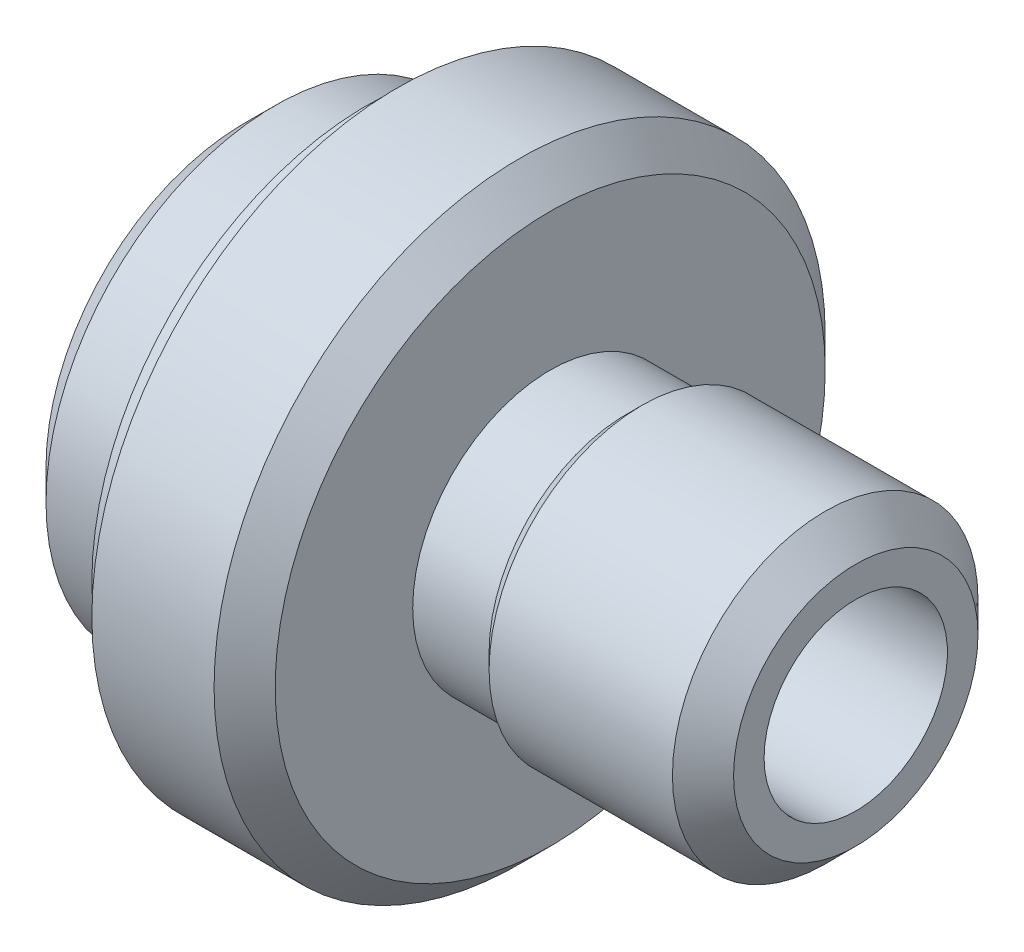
ISO-10303-21;
HEADER;
FILE_DESCRIPTION(('STEP AP214'),'2;1');
FILE_NAME('part.step','',(''),(''),'','','');
FILE_SCHEMA(('AUTOMOTIVE_DESIGN { 1 0 10303 214 1 1 1 1 }'));
ENDSEC;
DATA;
#1=APPLICATION_CONTEXT('core data for automotive mechanical design processes');
#2=APPLICATION_PROTOCOL_DEFINITION('international standard','automotive_design',2000,#1);
#3=PRODUCT_CONTEXT('',#1,'mechanical');
#4=PRODUCT('Part','Part','',(#3));
#5=PRODUCT_RELATED_PRODUCT_CATEGORY('part','',(#4));
#6=PRODUCT_DEFINITION_FORMATION('','',#4);
#7=PRODUCT_DEFINITION_CONTEXT('part definition',#1,'design');
#8=PRODUCT_DEFINITION('design','',#6,#7);
#9=PRODUCT_DEFINITION_SHAPE('','',#8);
#10=(LENGTH_UNIT() NAMED_UNIT(*) SI_UNIT(.MILLI.,.METRE.));
#11=(NAMED_UNIT(*) PLANE_ANGLE_UNIT() SI_UNIT($,.RADIAN.));
#12=(NAMED_UNIT(*) SI_UNIT($,.STERADIAN.) SOLID_ANGLE_UNIT());
#13=UNCERTAINTY_MEASURE_WITH_UNIT(LENGTH_MEASURE(1.E-05),#10,'distance_accuracy_value','');
#14=(GEOMETRIC_REPRESENTATION_CONTEXT(3) GLOBAL_UNCERTAINTY_ASSIGNED_CONTEXT((#13)) GLOBAL_UNIT_ASSIGNED_CONTEXT((#10,
#11,#12)) REPRESENTATION_CONTEXT('',''));
#15=CARTESIAN_POINT('',(0.,0.,0.));
#16=DIRECTION('',(0.,0.,1.));
#17=DIRECTION('',(1.,0.,0.));
#18=AXIS2_PLACEMENT_3D('',#15,#16,#17);
#19=CARTESIAN_POINT('',(0.,0.,0.));
#20=DIRECTION('',(-1.,0.,0.));
#21=DIRECTION('',(0.,0.,1.));
#22=AXIS2_PLACEMENT_3D('',#19,#20,#21);
#23=PLANE('',#22);
#24=CARTESIAN_POINT('',(0.,0.,0.));
#25=DIRECTION('',(-1.,0.,0.));
#26=DIRECTION('',(0.,0.,1.));
#27=AXIS2_PLACEMENT_3D('',#24,#25,#26);
#28=CIRCLE('',#27,6.);
#29=CARTESIAN_POINT('',(0.,0.,6.));
#30=VERTEX_POINT('',#29);
#31=EDGE_CURVE('E106',#30,#30,#28,.T.);
#32=ORIENTED_EDGE('',*,*,#31,.F.);
#33=EDGE_LOOP('',(#32));
#34=FACE_BOUND('',#33,.T.);
#35=CARTESIAN_POINT('',(0.,0.,0.));
#36=DIRECTION('',(-1.,0.,0.));
#37=DIRECTION('',(0.,0.,1.));
#38=AXIS2_PLACEMENT_3D('',#35,#36,#37);
#39=CIRCLE('',#38,13.);
#40=CARTESIAN_POINT('',(0.,0.,13.));
#41=VERTEX_POINT('',#40);
#42=EDGE_CURVE('E64',#41,#41,#39,.T.);
#43=ORIENTED_EDGE('',*,*,#42,.T.);
#44=EDGE_LOOP('',(#43));
#45=FACE_BOUND('',#44,.T.);
#46=ADVANCED_FACE('F45',(#34,#45),#23,.T.);
#47=CARTESIAN_POINT('',(0.,0.,0.));
#48=DIRECTION('',(-1.,0.,0.));
#49=DIRECTION('',(0.,0.,1.));
#50=AXIS2_PLACEMENT_3D('',#47,#48,#49);
#51=CYLINDRICAL_SURFACE('',#50,15.);
#52=CARTESIAN_POINT('',(2.00000000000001,0.,0.));
#53=DIRECTION('',(-1.,0.,0.));
#54=DIRECTION('',(0.,0.,1.));
#55=AXIS2_PLACEMENT_3D('',#52,#53,#54);
#56=CIRCLE('',#55,15.);
#57=CARTESIAN_POINT('',(2.00000000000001,0.,15.));
#58=VERTEX_POINT('',#57);
#59=EDGE_CURVE('E59',#58,#58,#56,.F.);
#60=ORIENTED_EDGE('',*,*,#59,.T.);
#61=EDGE_LOOP('',(#60));
#62=FACE_BOUND('',#61,.T.);
#63=CARTESIAN_POINT('',(8.,0.,0.));
#64=DIRECTION('',(-1.,0.,0.));
#65=DIRECTION('',(0.,0.,1.));
#66=AXIS2_PLACEMENT_3D('',#63,#64,#65);
#67=CIRCLE('',#66,15.);
#68=CARTESIAN_POINT('',(8.,0.,15.));
#69=VERTEX_POINT('',#68);
#70=EDGE_CURVE('E86',#69,#69,#67,.T.);
#71=ORIENTED_EDGE('',*,*,#70,.T.);
#72=EDGE_LOOP('',(#71));
#73=FACE_BOUND('',#72,.T.);
#74=ADVANCED_FACE('F129',(#62,#73),#51,.T.);
#75=CARTESIAN_POINT('',(8.,-15.,0.));
#76=DIRECTION('',(-1.,0.,0.));
#77=DIRECTION('',(0.,0.,1.));
#78=AXIS2_PLACEMENT_3D('',#75,#76,#77);
#79=PLANE('',#78);
#80=CARTESIAN_POINT('',(8.,0.,0.));
#81=DIRECTION('',(-1.,0.,0.));
#82=DIRECTION('',(0.,0.,1.));
#83=AXIS2_PLACEMENT_3D('',#80,#81,#82);
#84=CIRCLE('',#83,18.);
#85=CARTESIAN_POINT('',(8.,0.,18.));
#86=VERTEX_POINT('',#85);
#87=EDGE_CURVE('E90',#86,#86,#84,.T.);
#88=ORIENTED_EDGE('',*,*,#87,.T.);
#89=EDGE_LOOP('',(#88));
#90=FACE_BOUND('',#89,.T.);
#91=ORIENTED_EDGE('',*,*,#70,.F.);
#92=EDGE_LOOP('',(#91));
#93=FACE_BOUND('',#92,.T.);
#94=ADVANCED_FACE('F135',(#90,#93),#79,.T.);
#95=CARTESIAN_POINT('',(0.,0.,0.));
#96=DIRECTION('',(-1.,0.,0.));
#97=DIRECTION('',(0.,0.,1.));
#98=AXIS2_PLACEMENT_3D('',#95,#96,#97);
#99=CYLINDRICAL_SURFACE('',#98,18.);
#100=CARTESIAN_POINT('',(10.,0.,0.));
#101=DIRECTION('',(-1.,0.,0.));
#102=DIRECTION('',(0.,0.,1.));
#103=AXIS2_PLACEMENT_3D('',#100,#101,#102);
#104=CIRCLE('',#103,18.);
#105=CARTESIAN_POINT('',(10.,0.,18.));
#106=VERTEX_POINT('',#105);
#107=EDGE_CURVE('E94',#106,#106,#104,.T.);
#108=ORIENTED_EDGE('',*,*,#107,.T.);
#109=EDGE_LOOP('',(#108));
#110=FACE_BOUND('',#109,.T.);
#111=ORIENTED_EDGE('',*,*,#87,.F.);
#112=EDGE_LOOP('',(#111));
#113=FACE_BOUND('',#112,.T.);
#114=ADVANCED_FACE('F169',(#110,#113),#99,.T.);
#115=CARTESIAN_POINT('',(10.,-18.,0.));
#116=DIRECTION('',(-1.,0.,0.));
#117=DIRECTION('',(0.,0.,1.));
#118=AXIS2_PLACEMENT_3D('',#115,#116,#117);
#119=PLANE('',#118);
#120=CARTESIAN_POINT('',(10.,0.,0.));
#121=DIRECTION('',(-1.,0.,0.));
#122=DIRECTION('',(0.,0.,1.));
#123=AXIS2_PLACEMENT_3D('',#120,#121,#122);
#124=CIRCLE('',#123,20.);
#125=CARTESIAN_POINT('',(10.,0.,20.));
#126=VERTEX_POINT('',#125);
#127=EDGE_CURVE('E98',#126,#126,#124,.T.);
#128=ORIENTED_EDGE('',*,*,#127,.T.);
#129=EDGE_LOOP('',(#128));
#130=FACE_BOUND('',#129,.T.);
#131=ORIENTED_EDGE('',*,*,#107,.F.);
#132=EDGE_LOOP('',(#131));
#133=FACE_BOUND('',#132,.T.);
#134=ADVANCED_FACE('F174',(#130,#133),#119,.T.);
#135=CARTESIAN_POINT('',(0.,0.,0.));
#136=DIRECTION('',(-1.,0.,0.));
#137=DIRECTION('',(0.,0.,1.));
#138=AXIS2_PLACEMENT_3D('',#135,#136,#137);
#139=CYLINDRICAL_SURFACE('',#138,20.);
#140=CARTESIAN_POINT('',(18.,0.,0.));
#141=DIRECTION('',(1.,0.,0.));
#142=DIRECTION('',(0.,0.,-1.));
#143=AXIS2_PLACEMENT_3D('',#140,#141,#142);
#144=CIRCLE('',#143,20.);
#145=CARTESIAN_POINT('',(18.,0.,-20.));
#146=VERTEX_POINT('',#145);
#147=EDGE_CURVE('E82',#146,#146,#144,.F.);
#148=ORIENTED_EDGE('',*,*,#147,.T.);
#149=EDGE_LOOP('',(#148));
#150=FACE_BOUND('',#149,.T.);
#151=ORIENTED_EDGE('',*,*,#127,.F.);
#152=EDGE_LOOP('',(#151));
#153=FACE_BOUND('',#152,.T.);
#154=ADVANCED_FACE('F180',(#150,#153),#139,.T.);
#155=CARTESIAN_POINT('',(20.,-20.,0.));
#156=DIRECTION('',(1.,0.,0.));
#157=DIRECTION('',(0.,0.,-1.));
#158=AXIS2_PLACEMENT_3D('',#155,#156,#157);
#159=PLANE('',#158);
#160=CARTESIAN_POINT('',(20.,0.,0.));
#161=DIRECTION('',(1.,0.,0.));
#162=DIRECTION('',(0.,0.,-1.));
#163=AXIS2_PLACEMENT_3D('',#160,#161,#162);
#164=CIRCLE('',#163,18.);
#165=CARTESIAN_POINT('',(20.,0.,-18.));
#166=VERTEX_POINT('',#165);
#167=EDGE_CURVE('E78',#166,#166,#164,.T.);
#168=ORIENTED_EDGE('',*,*,#167,.T.);
#169=EDGE_LOOP('',(#168));
#170=FACE_BOUND('',#169,.T.);
#171=CARTESIAN_POINT('',(20.,0.,0.));
#172=DIRECTION('',(-1.,0.,0.));
#173=DIRECTION('',(0.,0.,1.));
#174=AXIS2_PLACEMENT_3D('',#171,#172,#173);
#175=CIRCLE('',#174,9.);
#176=CARTESIAN_POINT('',(20.,0.,9.));
#177=VERTEX_POINT('',#176);
#178=EDGE_CURVE('E102',#177,#177,#175,.T.);
#179=ORIENTED_EDGE('',*,*,#178,.T.);
#180=EDGE_LOOP('',(#179));
#181=FACE_BOUND('',#180,.T.);
#182=ADVANCED_FACE('F184',(#170,#181),#159,.T.);
#183=CARTESIAN_POINT('',(0.,0.,0.));
#184=DIRECTION('',(-1.,0.,0.));
#185=DIRECTION('',(0.,0.,1.));
#186=AXIS2_PLACEMENT_3D('',#183,#184,#185);
#187=CYLINDRICAL_SURFACE('',#186,9.);
#188=CARTESIAN_POINT('',(25.,0.,0.));
#189=DIRECTION('',(1.,0.,0.));
#190=DIRECTION('',(0.,0.,-1.));
#191=AXIS2_PLACEMENT_3D('',#188,#189,#190);
#192=CIRCLE('',#191,9.);
#193=CARTESIAN_POINT('',(25.,0.,-9.));
#194=VERTEX_POINT('',#193);
#195=EDGE_CURVE('E10',#194,#194,#192,.F.);
#196=ORIENTED_EDGE('',*,*,#195,.T.);
#197=EDGE_LOOP('',(#196));
#198=FACE_BOUND('',#197,.T.);
#199=ORIENTED_EDGE('',*,*,#178,.F.);
#200=EDGE_LOOP('',(#199));
#201=FACE_BOUND('',#200,.T.);
#202=ADVANCED_FACE('F188',(#198,#201),#187,.T.);
#203=CARTESIAN_POINT('',(0.,0.,0.));
#204=DIRECTION('',(-1.,0.,0.));
#205=DIRECTION('',(0.,0.,1.));
#206=AXIS2_PLACEMENT_3D('',#203,#204,#205);
#207=CYLINDRICAL_SURFACE('',#206,10.);
#208=CARTESIAN_POINT('',(26.,0.,0.));
#209=DIRECTION('',(-1.,0.,0.));
#210=DIRECTION('',(0.,0.,1.));
#211=AXIS2_PLACEMENT_3D('',#208,#209,#210);
#212=CIRCLE('',#211,10.);
#213=CARTESIAN_POINT('',(26.,0.,10.));
#214=VERTEX_POINT('',#213);
#215=EDGE_CURVE('E54',#214,#214,#212,.F.);
#216=ORIENTED_EDGE('',*,*,#215,.T.);
#217=EDGE_LOOP('',(#216));
#218=FACE_BOUND('',#217,.T.);
#219=CARTESIAN_POINT('',(38.,0.,0.));
#220=DIRECTION('',(1.,0.,0.));
#221=DIRECTION('',(0.,0.,-1.));
#222=AXIS2_PLACEMENT_3D('',#219,#220,#221);
#223=CIRCLE('',#222,10.);
#224=CARTESIAN_POINT('',(38.,0.,-10.));
#225=VERTEX_POINT('',#224);
#226=EDGE_CURVE('E74',#225,#225,#223,.F.);
#227=ORIENTED_EDGE('',*,*,#226,.T.);
#228=EDGE_LOOP('',(#227));
#229=FACE_BOUND('',#228,.T.);
#230=ADVANCED_FACE('F192',(#218,#229),#207,.T.);
#231=CARTESIAN_POINT('',(40.,-10.,0.));
#232=DIRECTION('',(1.,0.,0.));
#233=DIRECTION('',(0.,0.,-1.));
#234=AXIS2_PLACEMENT_3D('',#231,#232,#233);
#235=PLANE('',#234);
#236=CARTESIAN_POINT('',(40.,0.,0.));
#237=DIRECTION('',(-1.,0.,0.));
#238=DIRECTION('',(0.,0.,1.));
#239=AXIS2_PLACEMENT_3D('',#236,#237,#238);
#240=CIRCLE('',#239,6.);
#241=CARTESIAN_POINT('',(40.,0.,6.));
#242=VERTEX_POINT('',#241);
#243=EDGE_CURVE('E110',#242,#242,#240,.T.);
#244=ORIENTED_EDGE('',*,*,#243,.T.);
#245=EDGE_LOOP('',(#244));
#246=FACE_BOUND('',#245,.T.);
#247=CARTESIAN_POINT('',(40.,0.,0.));
#248=DIRECTION('',(1.,0.,0.));
#249=DIRECTION('',(0.,0.,-1.));
#250=AXIS2_PLACEMENT_3D('',#247,#248,#249);
#251=CIRCLE('',#250,7.99999999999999);
#252=CARTESIAN_POINT('',(40.,0.,-7.99999999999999));
#253=VERTEX_POINT('',#252);
#254=EDGE_CURVE('E70',#253,#253,#251,.T.);
#255=ORIENTED_EDGE('',*,*,#254,.T.);
#256=EDGE_LOOP('',(#255));
#257=FACE_BOUND('',#256,.T.);
#258=ADVANCED_FACE('F115',(#246,#257),#235,.T.);
#259=CARTESIAN_POINT('',(18.,0.,0.));
#260=DIRECTION('',(-1.,0.,0.));
#261=DIRECTION('',(0.,0.,1.));
#262=AXIS2_PLACEMENT_3D('',#259,#260,#261);
#263=CONICAL_SURFACE('',#262,20.,0.785398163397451);
#264=ORIENTED_EDGE('',*,*,#167,.F.);
#265=EDGE_LOOP('',(#264));
#266=FACE_BOUND('',#265,.T.);
#267=ORIENTED_EDGE('',*,*,#147,.F.);
#268=EDGE_LOOP('',(#267));
#269=FACE_BOUND('',#268,.T.);
#270=ADVANCED_FACE('F143',(#266,#269),#263,.T.);
#271=CARTESIAN_POINT('',(38.,0.,0.));
#272=DIRECTION('',(-1.,0.,0.));
#273=DIRECTION('',(0.,0.,1.));
#274=AXIS2_PLACEMENT_3D('',#271,#272,#273);
#275=CONICAL_SURFACE('',#274,10.,0.78539816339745);
#276=ORIENTED_EDGE('',*,*,#254,.F.);
#277=EDGE_LOOP('',(#276));
#278=FACE_BOUND('',#277,.T.);
#279=ORIENTED_EDGE('',*,*,#226,.F.);
#280=EDGE_LOOP('',(#279));
#281=FACE_BOUND('',#280,.T.);
#282=ADVANCED_FACE('F149',(#278,#281),#275,.T.);
#283=CARTESIAN_POINT('',(0.,0.,0.));
#284=DIRECTION('',(1.,0.,0.));
#285=DIRECTION('',(0.,0.,-1.));
#286=AXIS2_PLACEMENT_3D('',#283,#284,#285);
#287=CONICAL_SURFACE('',#286,13.,0.785398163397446);
#288=ORIENTED_EDGE('',*,*,#59,.F.);
#289=EDGE_LOOP('',(#288));
#290=FACE_BOUND('',#289,.T.);
#291=ORIENTED_EDGE('',*,*,#42,.F.);
#292=EDGE_LOOP('',(#291));
#293=FACE_BOUND('',#292,.T.);
#294=ADVANCED_FACE('F125',(#290,#293),#287,.T.);
#295=CARTESIAN_POINT('',(24.,0.,0.));
#296=DIRECTION('',(1.,0.,0.));
#297=DIRECTION('',(0.,0.,-1.));
#298=AXIS2_PLACEMENT_3D('',#295,#296,#297);
#299=CONICAL_SURFACE('',#298,7.99999999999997,0.785398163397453);
#300=ORIENTED_EDGE('',*,*,#215,.F.);
#301=EDGE_LOOP('',(#300));
#302=FACE_BOUND('',#301,.T.);
#303=ORIENTED_EDGE('',*,*,#195,.F.);
#304=EDGE_LOOP('',(#303));
#305=FACE_BOUND('',#304,.T.);
#306=ADVANCED_FACE('F48',(#302,#305),#299,.T.);
#307=CARTESIAN_POINT('',(40.,0.,0.));
#308=DIRECTION('',(-1.,0.,0.));
#309=DIRECTION('',(0.,0.,1.));
#310=AXIS2_PLACEMENT_3D('',#307,#308,#309);
#311=CYLINDRICAL_SURFACE('',#310,6.);
#312=ORIENTED_EDGE('',*,*,#31,.T.);
#313=EDGE_LOOP('',(#312));
#314=FACE_BOUND('',#313,.T.);
#315=ORIENTED_EDGE('',*,*,#243,.F.);
#316=EDGE_LOOP('',(#315));
#317=FACE_BOUND('',#316,.T.);
#318=ADVANCED_FACE('F118',(#314,#317),#311,.F.);
#319=CLOSED_SHELL('',(#46,#74,#94,#114,#134,#154,#182,#202,#230,#258,#270,#282,#294,#306,#318));
#320=MANIFOLD_SOLID_BREP('B2',#319);
#321=ADVANCED_BREP_SHAPE_REPRESENTATION('',(#18,#320),#14);
#322=SHAPE_DEFINITION_REPRESENTATION(#9,#321);
ENDSEC;
END-ISO-10303-21;
